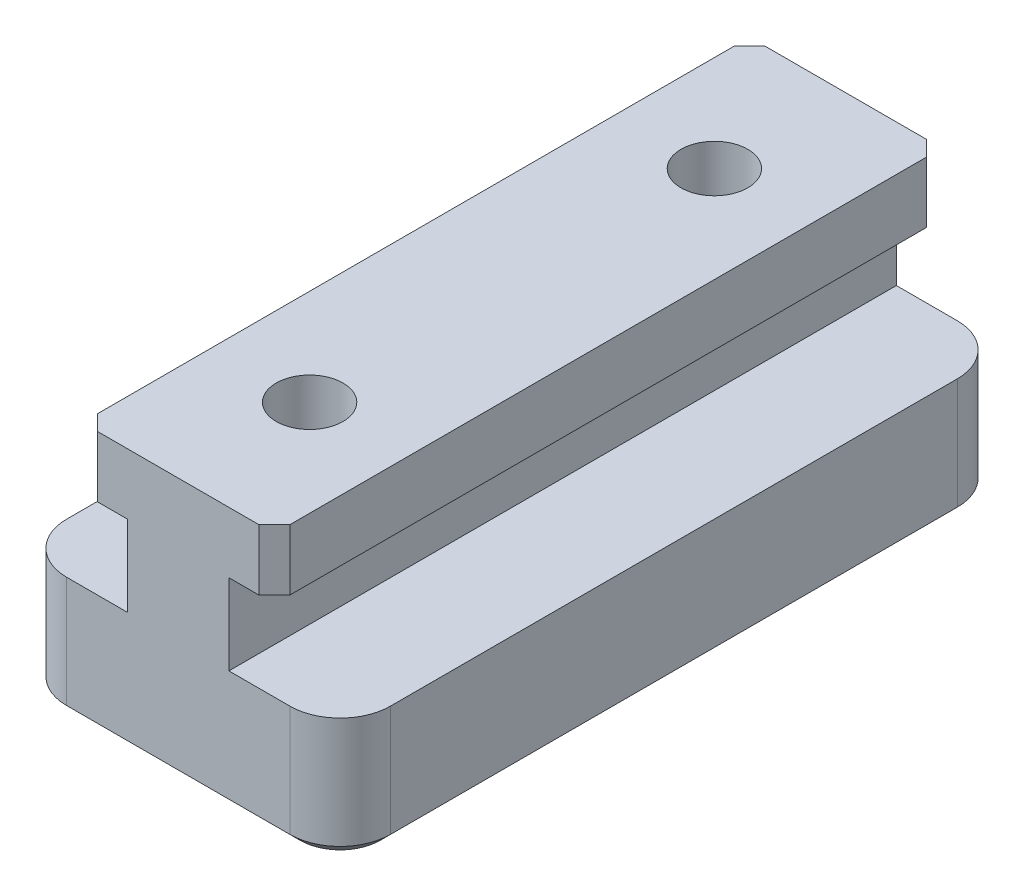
ISO-10303-21;
HEADER;
FILE_DESCRIPTION(('STEP AP214'),'2;1');
FILE_NAME('part.step','',(''),(''),'','','');
FILE_SCHEMA(('AUTOMOTIVE_DESIGN { 1 0 10303 214 1 1 1 1 }'));
ENDSEC;
DATA;
#1=APPLICATION_CONTEXT('core data for automotive mechanical design processes');
#2=APPLICATION_PROTOCOL_DEFINITION('international standard','automotive_design',2000,#1);
#3=PRODUCT_CONTEXT('',#1,'mechanical');
#4=PRODUCT('Part','Part','',(#3));
#5=PRODUCT_RELATED_PRODUCT_CATEGORY('part','',(#4));
#6=PRODUCT_DEFINITION_FORMATION('','',#4);
#7=PRODUCT_DEFINITION_CONTEXT('part definition',#1,'design');
#8=PRODUCT_DEFINITION('design','',#6,#7);
#9=PRODUCT_DEFINITION_SHAPE('','',#8);
#10=(LENGTH_UNIT() NAMED_UNIT(*) SI_UNIT(.MILLI.,.METRE.));
#11=(NAMED_UNIT(*) PLANE_ANGLE_UNIT() SI_UNIT($,.RADIAN.));
#12=(NAMED_UNIT(*) SI_UNIT($,.STERADIAN.) SOLID_ANGLE_UNIT());
#13=UNCERTAINTY_MEASURE_WITH_UNIT(LENGTH_MEASURE(1.E-05),#10,'distance_accuracy_value','');
#14=(GEOMETRIC_REPRESENTATION_CONTEXT(3) GLOBAL_UNCERTAINTY_ASSIGNED_CONTEXT((#13)) GLOBAL_UNIT_ASSIGNED_CONTEXT((#10,
#11,#12)) REPRESENTATION_CONTEXT('',''));
#15=CARTESIAN_POINT('',(0.,0.,0.));
#16=DIRECTION('',(0.,0.,1.));
#17=DIRECTION('',(1.,0.,0.));
#18=AXIS2_PLACEMENT_3D('',#15,#16,#17);
#19=CARTESIAN_POINT('',(-4.7498,5.0038,16.49));
#20=DIRECTION('',(1.,0.,0.));
#21=DIRECTION('',(0.,0.,-1.));
#22=AXIS2_PLACEMENT_3D('',#19,#20,#21);
#23=PLANE('',#22);
#24=DIRECTION('',(0.,0.,-1.));
#25=VECTOR('',#24,1.);
#26=CARTESIAN_POINT('',(-4.7498,5.0038,16.49));
#27=LINE('',#26,#25);
#28=CARTESIAN_POINT('',(-4.7498,5.0038,15.728));
#29=VERTEX_POINT('',#28);
#30=CARTESIAN_POINT('',(-4.7498,5.0038,-15.728));
#31=VERTEX_POINT('',#30);
#32=EDGE_CURVE('E239',#29,#31,#27,.T.);
#33=ORIENTED_EDGE('',*,*,#32,.T.);
#34=DIRECTION('',(0.,-1.,0.));
#35=VECTOR('',#34,1.);
#36=CARTESIAN_POINT('',(-4.7498,5.0038,-15.728));
#37=LINE('',#36,#35);
#38=CARTESIAN_POINT('',(-4.7498,1.9916,-15.728));
#39=VERTEX_POINT('',#38);
#40=EDGE_CURVE('E385',#31,#39,#37,.T.);
#41=ORIENTED_EDGE('',*,*,#40,.T.);
#42=DIRECTION('',(0.,0.,-1.));
#43=VECTOR('',#42,1.);
#44=CARTESIAN_POINT('',(-4.7498,1.9916,16.49));
#45=LINE('',#44,#43);
#46=CARTESIAN_POINT('',(-4.7498,1.9916,15.728));
#47=VERTEX_POINT('',#46);
#48=EDGE_CURVE('E219',#47,#39,#45,.T.);
#49=ORIENTED_EDGE('',*,*,#48,.F.);
#50=DIRECTION('',(0.,1.,0.));
#51=VECTOR('',#50,1.);
#52=CARTESIAN_POINT('',(-4.7498,5.0038,15.728));
#53=LINE('',#52,#51);
#54=EDGE_CURVE('E383',#47,#29,#53,.T.);
#55=ORIENTED_EDGE('',*,*,#54,.T.);
#56=EDGE_LOOP('',(#33,#41,#49,#55));
#57=FACE_BOUND('',#56,.T.);
#58=ADVANCED_FACE('F39',(#57),#23,.F.);
#59=CARTESIAN_POINT('',(-4.7498,1.9916,16.49));
#60=DIRECTION('',(0.,1.,0.));
#61=DIRECTION('',(-1.,0.,0.));
#62=AXIS2_PLACEMENT_3D('',#59,#60,#61);
#63=PLANE('',#62);
#64=ORIENTED_EDGE('',*,*,#48,.T.);
#65=DIRECTION('',(-0.707106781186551,0.,0.707106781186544));
#66=VECTOR('',#65,1.);
#67=CARTESIAN_POINT('',(-4.7498,1.9916,-15.728));
#68=LINE('',#67,#66);
#69=CARTESIAN_POINT('',(-3.98779999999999,1.9916,-16.49));
#70=VERTEX_POINT('',#69);
#71=EDGE_CURVE('E61',#39,#70,#68,.F.);
#72=ORIENTED_EDGE('',*,*,#71,.T.);
#73=DIRECTION('',(1.,0.,0.));
#74=VECTOR('',#73,1.);
#75=CARTESIAN_POINT('',(-4.7498,1.9916,-16.49));
#76=LINE('',#75,#74);
#77=CARTESIAN_POINT('',(-2.5019,1.9916,-16.49));
#78=VERTEX_POINT('',#77);
#79=EDGE_CURVE('E216',#70,#78,#76,.T.);
#80=ORIENTED_EDGE('',*,*,#79,.T.);
#81=DIRECTION('',(0.,0.,-1.));
#82=VECTOR('',#81,1.);
#83=CARTESIAN_POINT('',(-2.5019,1.9916,16.49));
#84=LINE('',#83,#82);
#85=CARTESIAN_POINT('',(-2.5019,1.9916,16.49));
#86=VERTEX_POINT('',#85);
#87=EDGE_CURVE('E212',#86,#78,#84,.T.);
#88=ORIENTED_EDGE('',*,*,#87,.F.);
#89=DIRECTION('',(1.,0.,0.));
#90=VECTOR('',#89,1.);
#91=CARTESIAN_POINT('',(-4.7498,1.9916,16.49));
#92=LINE('',#91,#90);
#93=CARTESIAN_POINT('',(-3.9878,1.9916,16.49));
#94=VERTEX_POINT('',#93);
#95=EDGE_CURVE('E200',#94,#86,#92,.T.);
#96=ORIENTED_EDGE('',*,*,#95,.F.);
#97=DIRECTION('',(-0.707106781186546,0.,-0.707106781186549));
#98=VECTOR('',#97,1.);
#99=CARTESIAN_POINT('',(-3.9878,1.9916,16.49));
#100=LINE('',#99,#98);
#101=EDGE_CURVE('E54',#94,#47,#100,.T.);
#102=ORIENTED_EDGE('',*,*,#101,.T.);
#103=EDGE_LOOP('',(#64,#72,#80,#88,#96,#102));
#104=FACE_BOUND('',#103,.T.);
#105=ADVANCED_FACE('F214',(#104),#63,.F.);
#106=CARTESIAN_POINT('',(-2.5019,1.9916,16.49));
#107=DIRECTION('',(1.,0.,0.));
#108=DIRECTION('',(0.,1.,0.));
#109=AXIS2_PLACEMENT_3D('',#106,#107,#108);
#110=PLANE('',#109);
#111=DIRECTION('',(0.,-1.,0.));
#112=VECTOR('',#111,1.);
#113=CARTESIAN_POINT('',(-2.5019,1.9916,-16.49));
#114=LINE('',#113,#112);
#115=CARTESIAN_POINT('',(-2.5019,-1.9962,-16.49));
#116=VERTEX_POINT('',#115);
#117=EDGE_CURVE('E241',#78,#116,#114,.T.);
#118=ORIENTED_EDGE('',*,*,#117,.T.);
#119=DIRECTION('',(0.,0.,-1.));
#120=VECTOR('',#119,1.);
#121=CARTESIAN_POINT('',(-2.5019,-1.9962,16.49));
#122=LINE('',#121,#120);
#123=CARTESIAN_POINT('',(-2.5019,-1.9962,16.49));
#124=VERTEX_POINT('',#123);
#125=EDGE_CURVE('E220',#124,#116,#122,.T.);
#126=ORIENTED_EDGE('',*,*,#125,.F.);
#127=DIRECTION('',(0.,-1.,0.));
#128=VECTOR('',#127,1.);
#129=CARTESIAN_POINT('',(-2.5019,1.9916,16.49));
#130=LINE('',#129,#128);
#131=EDGE_CURVE('E206',#86,#124,#130,.T.);
#132=ORIENTED_EDGE('',*,*,#131,.F.);
#133=ORIENTED_EDGE('',*,*,#87,.T.);
#134=EDGE_LOOP('',(#118,#126,#132,#133));
#135=FACE_BOUND('',#134,.T.);
#136=ADVANCED_FACE('F222',(#135),#110,.F.);
#137=CARTESIAN_POINT('',(-2.5019,-1.9962,16.49));
#138=DIRECTION('',(0.,-1.,0.));
#139=DIRECTION('',(1.,0.,0.));
#140=AXIS2_PLACEMENT_3D('',#137,#138,#139);
#141=PLANE('',#140);
#142=DIRECTION('',(0.,0.,-1.));
#143=VECTOR('',#142,1.);
#144=CARTESIAN_POINT('',(-8.,-1.9962,16.49));
#145=LINE('',#144,#143);
#146=CARTESIAN_POINT('',(-8.,-1.9962,14.0008));
#147=VERTEX_POINT('',#146);
#148=CARTESIAN_POINT('',(-8.,-1.9962,-14.0008));
#149=VERTEX_POINT('',#148);
#150=EDGE_CURVE('E273',#147,#149,#145,.T.);
#151=ORIENTED_EDGE('',*,*,#150,.F.);
#152=CARTESIAN_POINT('',(-5.5108,-1.9962,14.0008));
#153=DIRECTION('',(0.,-1.,0.));
#154=DIRECTION('',(1.,0.,0.));
#155=AXIS2_PLACEMENT_3D('',#152,#153,#154);
#156=CIRCLE('',#155,2.4892);
#157=CARTESIAN_POINT('',(-5.5108,-1.9962,16.49));
#158=VERTEX_POINT('',#157);
#159=EDGE_CURVE('E290',#147,#158,#156,.F.);
#160=ORIENTED_EDGE('',*,*,#159,.T.);
#161=DIRECTION('',(-1.,0.,0.));
#162=VECTOR('',#161,1.);
#163=CARTESIAN_POINT('',(-2.5019,-1.9962,16.49));
#164=LINE('',#163,#162);
#165=EDGE_CURVE('E225',#124,#158,#164,.T.);
#166=ORIENTED_EDGE('',*,*,#165,.F.);
#167=ORIENTED_EDGE('',*,*,#125,.T.);
#168=DIRECTION('',(-1.,0.,0.));
#169=VECTOR('',#168,1.);
#170=CARTESIAN_POINT('',(-2.5019,-1.9962,-16.49));
#171=LINE('',#170,#169);
#172=CARTESIAN_POINT('',(-5.5108,-1.9962,-16.49));
#173=VERTEX_POINT('',#172);
#174=EDGE_CURVE('E244',#116,#173,#171,.T.);
#175=ORIENTED_EDGE('',*,*,#174,.T.);
#176=CARTESIAN_POINT('',(-5.5108,-1.9962,-14.0008));
#177=DIRECTION('',(0.,-1.,0.));
#178=DIRECTION('',(1.,0.,0.));
#179=AXIS2_PLACEMENT_3D('',#176,#177,#178);
#180=CIRCLE('',#179,2.4892);
#181=EDGE_CURVE('E288',#173,#149,#180,.F.);
#182=ORIENTED_EDGE('',*,*,#181,.T.);
#183=EDGE_LOOP('',(#151,#160,#166,#167,#175,#182));
#184=FACE_BOUND('',#183,.T.);
#185=ADVANCED_FACE('F765',(#184),#141,.F.);
#186=CARTESIAN_POINT('',(-8.,-1.9962,16.49));
#187=DIRECTION('',(1.,0.,0.));
#188=DIRECTION('',(0.,0.,-1.));
#189=AXIS2_PLACEMENT_3D('',#186,#187,#188);
#190=PLANE('',#189);
#191=DIRECTION('',(0.,-1.,0.));
#192=VECTOR('',#191,1.);
#193=CARTESIAN_POINT('',(-8.,-1.9962,-14.0008));
#194=LINE('',#193,#192);
#195=CARTESIAN_POINT('',(-8.,-7.4882,-14.0008));
#196=VERTEX_POINT('',#195);
#197=EDGE_CURVE('E283',#149,#196,#194,.T.);
#198=ORIENTED_EDGE('',*,*,#197,.T.);
#199=DIRECTION('',(0.,0.,1.));
#200=VECTOR('',#199,1.);
#201=CARTESIAN_POINT('',(-8.,-7.4882,16.49));
#202=LINE('',#201,#200);
#203=CARTESIAN_POINT('',(-8.,-7.4882,14.0008));
#204=VERTEX_POINT('',#203);
#205=EDGE_CURVE('E330',#196,#204,#202,.T.);
#206=ORIENTED_EDGE('',*,*,#205,.T.);
#207=DIRECTION('',(0.,-1.,0.));
#208=VECTOR('',#207,1.);
#209=CARTESIAN_POINT('',(-8.,-1.9962,14.0008));
#210=LINE('',#209,#208);
#211=EDGE_CURVE('E286',#204,#147,#210,.F.);
#212=ORIENTED_EDGE('',*,*,#211,.T.);
#213=ORIENTED_EDGE('',*,*,#150,.T.);
#214=EDGE_LOOP('',(#198,#206,#212,#213));
#215=FACE_BOUND('',#214,.T.);
#216=ADVANCED_FACE('F463',(#215),#190,.F.);
#217=CARTESIAN_POINT('',(-8.,-7.9962,16.49));
#218=DIRECTION('',(0.,1.,0.));
#219=DIRECTION('',(0.,0.,1.));
#220=AXIS2_PLACEMENT_3D('',#217,#218,#219);
#221=PLANE('',#220);
#222=CARTESIAN_POINT('',(0.,-7.9962,10.));
#223=DIRECTION('',(0.,-1.,0.));
#224=DIRECTION('',(0.,0.,-1.));
#225=AXIS2_PLACEMENT_3D('',#222,#223,#224);
#226=CIRCLE('',#225,1.65);
#227=CARTESIAN_POINT('',(0.,-7.9962,8.35));
#228=VERTEX_POINT('',#227);
#229=EDGE_CURVE('E831',#228,#228,#226,.T.);
#230=ORIENTED_EDGE('',*,*,#229,.F.);
#231=EDGE_LOOP('',(#230));
#232=FACE_BOUND('',#231,.T.);
#233=CARTESIAN_POINT('',(0.,-7.9962,-10.));
#234=DIRECTION('',(0.,-1.,0.));
#235=DIRECTION('',(0.,0.,-1.));
#236=AXIS2_PLACEMENT_3D('',#233,#234,#235);
#237=CIRCLE('',#236,1.65);
#238=CARTESIAN_POINT('',(0.,-7.9962,-11.65));
#239=VERTEX_POINT('',#238);
#240=EDGE_CURVE('E834',#239,#239,#237,.T.);
#241=ORIENTED_EDGE('',*,*,#240,.F.);
#242=EDGE_LOOP('',(#241));
#243=FACE_BOUND('',#242,.T.);
#244=CARTESIAN_POINT('',(-5.5108,-7.9962,-14.0008));
#245=DIRECTION('',(0.,1.,0.));
#246=DIRECTION('',(0.,0.,1.));
#247=AXIS2_PLACEMENT_3D('',#244,#245,#246);
#248=CIRCLE('',#247,1.9812);
#249=CARTESIAN_POINT('',(-7.492,-7.9962,-14.0008));
#250=VERTEX_POINT('',#249);
#251=CARTESIAN_POINT('',(-5.5108,-7.9962,-15.982));
#252=VERTEX_POINT('',#251);
#253=EDGE_CURVE('E318',#250,#252,#248,.F.);
#254=ORIENTED_EDGE('',*,*,#253,.T.);
#255=DIRECTION('',(1.,0.,0.));
#256=VECTOR('',#255,1.);
#257=CARTESIAN_POINT('',(-8.,-7.9962,-15.982));
#258=LINE('',#257,#256);
#259=CARTESIAN_POINT('',(5.5108,-7.9962,-15.982));
#260=VERTEX_POINT('',#259);
#261=EDGE_CURVE('E320',#252,#260,#258,.T.);
#262=ORIENTED_EDGE('',*,*,#261,.T.);
#263=CARTESIAN_POINT('',(5.5108,-7.9962,-14.0008));
#264=DIRECTION('',(0.,1.,0.));
#265=DIRECTION('',(0.,0.,1.));
#266=AXIS2_PLACEMENT_3D('',#263,#264,#265);
#267=CIRCLE('',#266,1.9812);
#268=CARTESIAN_POINT('',(7.492,-7.9962,-14.0008));
#269=VERTEX_POINT('',#268);
#270=EDGE_CURVE('E316',#260,#269,#267,.F.);
#271=ORIENTED_EDGE('',*,*,#270,.T.);
#272=DIRECTION('',(0.,0.,1.));
#273=VECTOR('',#272,1.);
#274=CARTESIAN_POINT('',(7.492,-7.9962,16.49));
#275=LINE('',#274,#273);
#276=CARTESIAN_POINT('',(7.492,-7.9962,14.0008));
#277=VERTEX_POINT('',#276);
#278=EDGE_CURVE('E312',#269,#277,#275,.T.);
#279=ORIENTED_EDGE('',*,*,#278,.T.);
#280=CARTESIAN_POINT('',(5.5108,-7.9962,14.0008));
#281=DIRECTION('',(0.,1.,0.));
#282=DIRECTION('',(0.,0.,1.));
#283=AXIS2_PLACEMENT_3D('',#280,#281,#282);
#284=CIRCLE('',#283,1.9812);
#285=CARTESIAN_POINT('',(5.5108,-7.9962,15.982));
#286=VERTEX_POINT('',#285);
#287=EDGE_CURVE('E308',#277,#286,#284,.F.);
#288=ORIENTED_EDGE('',*,*,#287,.T.);
#289=DIRECTION('',(-1.,0.,0.));
#290=VECTOR('',#289,1.);
#291=CARTESIAN_POINT('',(-5.5108,-7.9962,15.982));
#292=LINE('',#291,#290);
#293=CARTESIAN_POINT('',(-5.5108,-7.9962,15.982));
#294=VERTEX_POINT('',#293);
#295=EDGE_CURVE('E306',#286,#294,#292,.T.);
#296=ORIENTED_EDGE('',*,*,#295,.T.);
#297=CARTESIAN_POINT('',(-5.5108,-7.9962,14.0008));
#298=DIRECTION('',(0.,1.,0.));
#299=DIRECTION('',(0.,0.,1.));
#300=AXIS2_PLACEMENT_3D('',#297,#298,#299);
#301=CIRCLE('',#300,1.9812);
#302=CARTESIAN_POINT('',(-7.492,-7.9962,14.0008));
#303=VERTEX_POINT('',#302);
#304=EDGE_CURVE('E310',#294,#303,#301,.F.);
#305=ORIENTED_EDGE('',*,*,#304,.T.);
#306=DIRECTION('',(0.,0.,-1.));
#307=VECTOR('',#306,1.);
#308=CARTESIAN_POINT('',(-7.492,-7.9962,16.49));
#309=LINE('',#308,#307);
#310=EDGE_CURVE('E314',#303,#250,#309,.T.);
#311=ORIENTED_EDGE('',*,*,#310,.T.);
#312=EDGE_LOOP('',(#254,#262,#271,#279,#288,#296,#305,#311));
#313=FACE_BOUND('',#312,.T.);
#314=ADVANCED_FACE('F451',(#232,#243,#313),#221,.F.);
#315=CARTESIAN_POINT('',(8.,-1.9962,16.49));
#316=DIRECTION('',(-1.,0.,0.));
#317=DIRECTION('',(0.,0.,1.));
#318=AXIS2_PLACEMENT_3D('',#315,#316,#317);
#319=PLANE('',#318);
#320=DIRECTION('',(0.,1.,0.));
#321=VECTOR('',#320,1.);
#322=CARTESIAN_POINT('',(8.,-7.9962,14.0008));
#323=LINE('',#322,#321);
#324=CARTESIAN_POINT('',(8.,-1.9962,14.0008));
#325=VERTEX_POINT('',#324);
#326=CARTESIAN_POINT('',(8.,-7.4882,14.0008));
#327=VERTEX_POINT('',#326);
#328=EDGE_CURVE('E297',#325,#327,#323,.F.);
#329=ORIENTED_EDGE('',*,*,#328,.T.);
#330=DIRECTION('',(0.,0.,-1.));
#331=VECTOR('',#330,1.);
#332=CARTESIAN_POINT('',(8.,-7.4882,16.49));
#333=LINE('',#332,#331);
#334=CARTESIAN_POINT('',(8.,-7.4882,-14.0008));
#335=VERTEX_POINT('',#334);
#336=EDGE_CURVE('E332',#327,#335,#333,.T.);
#337=ORIENTED_EDGE('',*,*,#336,.T.);
#338=DIRECTION('',(0.,1.,0.));
#339=VECTOR('',#338,1.);
#340=CARTESIAN_POINT('',(8.,-1.9962,-14.0008));
#341=LINE('',#340,#339);
#342=CARTESIAN_POINT('',(8.,-1.9962,-14.0008));
#343=VERTEX_POINT('',#342);
#344=EDGE_CURVE('E300',#335,#343,#341,.T.);
#345=ORIENTED_EDGE('',*,*,#344,.T.);
#346=DIRECTION('',(0.,0.,-1.));
#347=VECTOR('',#346,1.);
#348=CARTESIAN_POINT('',(8.,-1.9962,16.49));
#349=LINE('',#348,#347);
#350=EDGE_CURVE('E270',#325,#343,#349,.T.);
#351=ORIENTED_EDGE('',*,*,#350,.F.);
#352=EDGE_LOOP('',(#329,#337,#345,#351));
#353=FACE_BOUND('',#352,.T.);
#354=ADVANCED_FACE('F495',(#353),#319,.F.);
#355=CARTESIAN_POINT('',(2.5019,-1.9962,16.49));
#356=DIRECTION('',(0.,-1.,0.));
#357=DIRECTION('',(1.,0.,0.));
#358=AXIS2_PLACEMENT_3D('',#355,#356,#357);
#359=PLANE('',#358);
#360=ORIENTED_EDGE('',*,*,#350,.T.);
#361=CARTESIAN_POINT('',(5.5108,-1.9962,-14.0008));
#362=DIRECTION('',(0.,-1.,0.));
#363=DIRECTION('',(1.,0.,0.));
#364=AXIS2_PLACEMENT_3D('',#361,#362,#363);
#365=CIRCLE('',#364,2.4892);
#366=CARTESIAN_POINT('',(5.5108,-1.9962,-16.49));
#367=VERTEX_POINT('',#366);
#368=EDGE_CURVE('E304',#343,#367,#365,.F.);
#369=ORIENTED_EDGE('',*,*,#368,.T.);
#370=DIRECTION('',(-1.,0.,0.));
#371=VECTOR('',#370,1.);
#372=CARTESIAN_POINT('',(2.5019,-1.9962,-16.49));
#373=LINE('',#372,#371);
#374=CARTESIAN_POINT('',(2.5019,-1.9962,-16.49));
#375=VERTEX_POINT('',#374);
#376=EDGE_CURVE('E247',#367,#375,#373,.T.);
#377=ORIENTED_EDGE('',*,*,#376,.T.);
#378=DIRECTION('',(0.,0.,-1.));
#379=VECTOR('',#378,1.);
#380=CARTESIAN_POINT('',(2.5019,-1.9962,16.49));
#381=LINE('',#380,#379);
#382=CARTESIAN_POINT('',(2.5019,-1.9962,16.49));
#383=VERTEX_POINT('',#382);
#384=EDGE_CURVE('E267',#383,#375,#381,.T.);
#385=ORIENTED_EDGE('',*,*,#384,.F.);
#386=DIRECTION('',(-1.,0.,0.));
#387=VECTOR('',#386,1.);
#388=CARTESIAN_POINT('',(2.5019,-1.9962,16.49));
#389=LINE('',#388,#387);
#390=CARTESIAN_POINT('',(5.5108,-1.9962,16.49));
#391=VERTEX_POINT('',#390);
#392=EDGE_CURVE('E227',#391,#383,#389,.T.);
#393=ORIENTED_EDGE('',*,*,#392,.F.);
#394=CARTESIAN_POINT('',(5.5108,-1.9962,14.0008));
#395=DIRECTION('',(0.,-1.,0.));
#396=DIRECTION('',(1.,0.,0.));
#397=AXIS2_PLACEMENT_3D('',#394,#395,#396);
#398=CIRCLE('',#397,2.4892);
#399=EDGE_CURVE('E302',#391,#325,#398,.F.);
#400=ORIENTED_EDGE('',*,*,#399,.T.);
#401=EDGE_LOOP('',(#360,#369,#377,#385,#393,#400));
#402=FACE_BOUND('',#401,.T.);
#403=ADVANCED_FACE('F430',(#402),#359,.F.);
#404=CARTESIAN_POINT('',(2.5019,1.9916,16.49));
#405=DIRECTION('',(-1.,0.,0.));
#406=DIRECTION('',(0.,-1.,0.));
#407=AXIS2_PLACEMENT_3D('',#404,#405,#406);
#408=PLANE('',#407);
#409=DIRECTION('',(0.,1.,0.));
#410=VECTOR('',#409,1.);
#411=CARTESIAN_POINT('',(2.5019,1.9916,-16.49));
#412=LINE('',#411,#410);
#413=CARTESIAN_POINT('',(2.5019,1.9916,-16.49));
#414=VERTEX_POINT('',#413);
#415=EDGE_CURVE('E249',#375,#414,#412,.T.);
#416=ORIENTED_EDGE('',*,*,#415,.T.);
#417=DIRECTION('',(0.,0.,-1.));
#418=VECTOR('',#417,1.);
#419=CARTESIAN_POINT('',(2.5019,1.9916,16.49));
#420=LINE('',#419,#418);
#421=CARTESIAN_POINT('',(2.5019,1.9916,16.49));
#422=VERTEX_POINT('',#421);
#423=EDGE_CURVE('E264',#422,#414,#420,.T.);
#424=ORIENTED_EDGE('',*,*,#423,.F.);
#425=DIRECTION('',(0.,1.,0.));
#426=VECTOR('',#425,1.);
#427=CARTESIAN_POINT('',(2.5019,1.9916,16.49));
#428=LINE('',#427,#426);
#429=EDGE_CURVE('E232',#383,#422,#428,.T.);
#430=ORIENTED_EDGE('',*,*,#429,.F.);
#431=ORIENTED_EDGE('',*,*,#384,.T.);
#432=EDGE_LOOP('',(#416,#424,#430,#431));
#433=FACE_BOUND('',#432,.T.);
#434=ADVANCED_FACE('F426',(#433),#408,.F.);
#435=CARTESIAN_POINT('',(4.7498,1.9916,16.49));
#436=DIRECTION('',(0.,1.,0.));
#437=DIRECTION('',(-1.,0.,0.));
#438=AXIS2_PLACEMENT_3D('',#435,#436,#437);
#439=PLANE('',#438);
#440=DIRECTION('',(1.,0.,0.));
#441=VECTOR('',#440,1.);
#442=CARTESIAN_POINT('',(4.7498,1.9916,-16.49));
#443=LINE('',#442,#441);
#444=CARTESIAN_POINT('',(3.98779999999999,1.9916,-16.49));
#445=VERTEX_POINT('',#444);
#446=EDGE_CURVE('E251',#414,#445,#443,.T.);
#447=ORIENTED_EDGE('',*,*,#446,.T.);
#448=DIRECTION('',(-0.707106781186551,0.,-0.707106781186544));
#449=VECTOR('',#448,1.);
#450=CARTESIAN_POINT('',(4.7498,1.9916,-15.728));
#451=LINE('',#450,#449);
#452=CARTESIAN_POINT('',(4.7498,1.9916,-15.728));
#453=VERTEX_POINT('',#452);
#454=EDGE_CURVE('E381',#445,#453,#451,.F.);
#455=ORIENTED_EDGE('',*,*,#454,.T.);
#456=DIRECTION('',(0.,0.,-1.));
#457=VECTOR('',#456,1.);
#458=CARTESIAN_POINT('',(4.7498,1.9916,16.49));
#459=LINE('',#458,#457);
#460=CARTESIAN_POINT('',(4.7498,1.9916,15.728));
#461=VERTEX_POINT('',#460);
#462=EDGE_CURVE('E261',#461,#453,#459,.T.);
#463=ORIENTED_EDGE('',*,*,#462,.F.);
#464=DIRECTION('',(-0.707106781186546,0.,0.707106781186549));
#465=VECTOR('',#464,1.);
#466=CARTESIAN_POINT('',(3.9878,1.9916,16.49));
#467=LINE('',#466,#465);
#468=CARTESIAN_POINT('',(3.9878,1.9916,16.49));
#469=VERTEX_POINT('',#468);
#470=EDGE_CURVE('E379',#461,#469,#467,.T.);
#471=ORIENTED_EDGE('',*,*,#470,.T.);
#472=DIRECTION('',(1.,0.,0.));
#473=VECTOR('',#472,1.);
#474=CARTESIAN_POINT('',(4.7498,1.9916,16.49));
#475=LINE('',#474,#473);
#476=EDGE_CURVE('E234',#422,#469,#475,.T.);
#477=ORIENTED_EDGE('',*,*,#476,.F.);
#478=ORIENTED_EDGE('',*,*,#423,.T.);
#479=EDGE_LOOP('',(#447,#455,#463,#471,#477,#478));
#480=FACE_BOUND('',#479,.T.);
#481=ADVANCED_FACE('F416',(#480),#439,.F.);
#482=CARTESIAN_POINT('',(4.7498,5.0038,16.49));
#483=DIRECTION('',(-1.,0.,0.));
#484=DIRECTION('',(0.,0.,1.));
#485=AXIS2_PLACEMENT_3D('',#482,#483,#484);
#486=PLANE('',#485);
#487=ORIENTED_EDGE('',*,*,#462,.T.);
#488=DIRECTION('',(0.,1.,0.));
#489=VECTOR('',#488,1.);
#490=CARTESIAN_POINT('',(4.7498,5.0038,-15.728));
#491=LINE('',#490,#489);
#492=CARTESIAN_POINT('',(4.7498,5.0038,-15.728));
#493=VERTEX_POINT('',#492);
#494=EDGE_CURVE('E364',#453,#493,#491,.T.);
#495=ORIENTED_EDGE('',*,*,#494,.T.);
#496=DIRECTION('',(0.,0.,-1.));
#497=VECTOR('',#496,1.);
#498=CARTESIAN_POINT('',(4.7498,5.0038,16.49));
#499=LINE('',#498,#497);
#500=CARTESIAN_POINT('',(4.7498,5.0038,15.728));
#501=VERTEX_POINT('',#500);
#502=EDGE_CURVE('E258',#501,#493,#499,.T.);
#503=ORIENTED_EDGE('',*,*,#502,.F.);
#504=DIRECTION('',(0.,-1.,0.));
#505=VECTOR('',#504,1.);
#506=CARTESIAN_POINT('',(4.7498,1.9916,15.728));
#507=LINE('',#506,#505);
#508=EDGE_CURVE('E340',#501,#461,#507,.T.);
#509=ORIENTED_EDGE('',*,*,#508,.T.);
#510=EDGE_LOOP('',(#487,#495,#503,#509));
#511=FACE_BOUND('',#510,.T.);
#512=ADVANCED_FACE('F418',(#511),#486,.F.);
#513=CARTESIAN_POINT('',(4.7498,5.0038,16.49));
#514=DIRECTION('',(0.,-1.,0.));
#515=DIRECTION('',(0.,0.,-1.));
#516=AXIS2_PLACEMENT_3D('',#513,#514,#515);
#517=PLANE('',#516);
#518=CARTESIAN_POINT('',(0.,5.0038,10.));
#519=DIRECTION('',(0.,-1.,0.));
#520=DIRECTION('',(0.,0.,-1.));
#521=AXIS2_PLACEMENT_3D('',#518,#519,#520);
#522=CIRCLE('',#521,1.65);
#523=CARTESIAN_POINT('',(0.,5.0038,8.35));
#524=VERTEX_POINT('',#523);
#525=EDGE_CURVE('E836',#524,#524,#522,.T.);
#526=ORIENTED_EDGE('',*,*,#525,.T.);
#527=EDGE_LOOP('',(#526));
#528=FACE_BOUND('',#527,.T.);
#529=CARTESIAN_POINT('',(0.,5.0038,-10.));
#530=DIRECTION('',(0.,-1.,0.));
#531=DIRECTION('',(0.,0.,-1.));
#532=AXIS2_PLACEMENT_3D('',#529,#530,#531);
#533=CIRCLE('',#532,1.65);
#534=CARTESIAN_POINT('',(0.,5.0038,-11.65));
#535=VERTEX_POINT('',#534);
#536=EDGE_CURVE('E344',#535,#535,#533,.T.);
#537=ORIENTED_EDGE('',*,*,#536,.T.);
#538=EDGE_LOOP('',(#537));
#539=FACE_BOUND('',#538,.T.);
#540=ORIENTED_EDGE('',*,*,#502,.T.);
#541=DIRECTION('',(0.707106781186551,0.,0.707106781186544));
#542=VECTOR('',#541,1.);
#543=CARTESIAN_POINT('',(4.7498,5.0038,-15.728));
#544=LINE('',#543,#542);
#545=CARTESIAN_POINT('',(3.98779999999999,5.0038,-16.49));
#546=VERTEX_POINT('',#545);
#547=EDGE_CURVE('E373',#493,#546,#544,.F.);
#548=ORIENTED_EDGE('',*,*,#547,.T.);
#549=DIRECTION('',(-1.,0.,0.));
#550=VECTOR('',#549,1.);
#551=CARTESIAN_POINT('',(4.7498,5.0038,-16.49));
#552=LINE('',#551,#550);
#553=CARTESIAN_POINT('',(-3.98779999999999,5.0038,-16.49));
#554=VERTEX_POINT('',#553);
#555=EDGE_CURVE('E209',#546,#554,#552,.T.);
#556=ORIENTED_EDGE('',*,*,#555,.T.);
#557=DIRECTION('',(0.707106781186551,0.,-0.707106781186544));
#558=VECTOR('',#557,1.);
#559=CARTESIAN_POINT('',(-4.7498,5.0038,-15.728));
#560=LINE('',#559,#558);
#561=EDGE_CURVE('E371',#554,#31,#560,.F.);
#562=ORIENTED_EDGE('',*,*,#561,.T.);
#563=ORIENTED_EDGE('',*,*,#32,.F.);
#564=DIRECTION('',(0.707106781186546,0.,0.707106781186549));
#565=VECTOR('',#564,1.);
#566=CARTESIAN_POINT('',(-3.9878,5.0038,16.49));
#567=LINE('',#566,#565);
#568=CARTESIAN_POINT('',(-3.9878,5.0038,16.49));
#569=VERTEX_POINT('',#568);
#570=EDGE_CURVE('E369',#29,#569,#567,.T.);
#571=ORIENTED_EDGE('',*,*,#570,.T.);
#572=DIRECTION('',(-1.,0.,0.));
#573=VECTOR('',#572,1.);
#574=CARTESIAN_POINT('',(4.7498,5.0038,16.49));
#575=LINE('',#574,#573);
#576=CARTESIAN_POINT('',(3.9878,5.0038,16.49));
#577=VERTEX_POINT('',#576);
#578=EDGE_CURVE('E237',#577,#569,#575,.T.);
#579=ORIENTED_EDGE('',*,*,#578,.F.);
#580=DIRECTION('',(0.707106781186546,0.,-0.707106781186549));
#581=VECTOR('',#580,1.);
#582=CARTESIAN_POINT('',(3.9878,5.0038,16.49));
#583=LINE('',#582,#581);
#584=EDGE_CURVE('E367',#577,#501,#583,.T.);
#585=ORIENTED_EDGE('',*,*,#584,.T.);
#586=EDGE_LOOP('',(#540,#548,#556,#562,#563,#571,#579,#585));
#587=FACE_BOUND('',#586,.T.);
#588=ADVANCED_FACE('F395',(#528,#539,#587),#517,.F.);
#589=CARTESIAN_POINT('',(0.,0.,16.49));
#590=DIRECTION('',(0.,0.,1.));
#591=DIRECTION('',(1.,0.,0.));
#592=AXIS2_PLACEMENT_3D('',#589,#590,#591);
#593=PLANE('',#592);
#594=ORIENTED_EDGE('',*,*,#578,.T.);
#595=DIRECTION('',(0.,-1.,0.));
#596=VECTOR('',#595,1.);
#597=CARTESIAN_POINT('',(-3.9878,1.9916,16.49));
#598=LINE('',#597,#596);
#599=EDGE_CURVE('E11',#569,#94,#598,.T.);
#600=ORIENTED_EDGE('',*,*,#599,.T.);
#601=ORIENTED_EDGE('',*,*,#95,.T.);
#602=ORIENTED_EDGE('',*,*,#131,.T.);
#603=ORIENTED_EDGE('',*,*,#165,.T.);
#604=DIRECTION('',(0.,-1.,0.));
#605=VECTOR('',#604,1.);
#606=CARTESIAN_POINT('',(-5.5108,-7.9962,16.49));
#607=LINE('',#606,#605);
#608=CARTESIAN_POINT('',(-5.5108,-7.4882,16.49));
#609=VERTEX_POINT('',#608);
#610=EDGE_CURVE('E280',#158,#609,#607,.T.);
#611=ORIENTED_EDGE('',*,*,#610,.T.);
#612=DIRECTION('',(1.,0.,0.));
#613=VECTOR('',#612,1.);
#614=CARTESIAN_POINT('',(5.5108,-7.4882,16.49));
#615=LINE('',#614,#613);
#616=CARTESIAN_POINT('',(5.5108,-7.4882,16.49));
#617=VERTEX_POINT('',#616);
#618=EDGE_CURVE('E338',#609,#617,#615,.T.);
#619=ORIENTED_EDGE('',*,*,#618,.T.);
#620=DIRECTION('',(0.,1.,0.));
#621=VECTOR('',#620,1.);
#622=CARTESIAN_POINT('',(5.5108,-1.9962,16.49));
#623=LINE('',#622,#621);
#624=EDGE_CURVE('E278',#617,#391,#623,.T.);
#625=ORIENTED_EDGE('',*,*,#624,.T.);
#626=ORIENTED_EDGE('',*,*,#392,.T.);
#627=ORIENTED_EDGE('',*,*,#429,.T.);
#628=ORIENTED_EDGE('',*,*,#476,.T.);
#629=DIRECTION('',(0.,1.,0.));
#630=VECTOR('',#629,1.);
#631=CARTESIAN_POINT('',(3.9878,5.0038,16.49));
#632=LINE('',#631,#630);
#633=EDGE_CURVE('E47',#469,#577,#632,.T.);
#634=ORIENTED_EDGE('',*,*,#633,.T.);
#635=EDGE_LOOP('',(#594,#600,#601,#602,#603,#611,#619,#625,#626,#627,#628,#634));
#636=FACE_BOUND('',#635,.T.);
#637=ADVANCED_FACE('F203',(#636),#593,.T.);
#638=CARTESIAN_POINT('',(0.,0.,-16.49));
#639=DIRECTION('',(0.,0.,1.));
#640=DIRECTION('',(1.,0.,0.));
#641=AXIS2_PLACEMENT_3D('',#638,#639,#640);
#642=PLANE('',#641);
#643=ORIENTED_EDGE('',*,*,#555,.F.);
#644=DIRECTION('',(0.,-1.,0.));
#645=VECTOR('',#644,1.);
#646=CARTESIAN_POINT('',(3.98779999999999,0.,-16.49));
#647=LINE('',#646,#645);
#648=EDGE_CURVE('E377',#546,#445,#647,.T.);
#649=ORIENTED_EDGE('',*,*,#648,.T.);
#650=ORIENTED_EDGE('',*,*,#446,.F.);
#651=ORIENTED_EDGE('',*,*,#415,.F.);
#652=ORIENTED_EDGE('',*,*,#376,.F.);
#653=DIRECTION('',(0.,1.,0.));
#654=VECTOR('',#653,1.);
#655=CARTESIAN_POINT('',(5.5108,0.,-16.49));
#656=LINE('',#655,#654);
#657=CARTESIAN_POINT('',(5.5108,-7.4882,-16.49));
#658=VERTEX_POINT('',#657);
#659=EDGE_CURVE('E292',#367,#658,#656,.F.);
#660=ORIENTED_EDGE('',*,*,#659,.T.);
#661=DIRECTION('',(-1.,0.,0.));
#662=VECTOR('',#661,1.);
#663=CARTESIAN_POINT('',(0.,-7.4882,-16.49));
#664=LINE('',#663,#662);
#665=CARTESIAN_POINT('',(-5.5108,-7.4882,-16.49));
#666=VERTEX_POINT('',#665);
#667=EDGE_CURVE('E323',#658,#666,#664,.T.);
#668=ORIENTED_EDGE('',*,*,#667,.T.);
#669=DIRECTION('',(0.,-1.,0.));
#670=VECTOR('',#669,1.);
#671=CARTESIAN_POINT('',(-5.5108,0.,-16.49));
#672=LINE('',#671,#670);
#673=EDGE_CURVE('E295',#666,#173,#672,.F.);
#674=ORIENTED_EDGE('',*,*,#673,.T.);
#675=ORIENTED_EDGE('',*,*,#174,.F.);
#676=ORIENTED_EDGE('',*,*,#117,.F.);
#677=ORIENTED_EDGE('',*,*,#79,.F.);
#678=DIRECTION('',(0.,1.,0.));
#679=VECTOR('',#678,1.);
#680=CARTESIAN_POINT('',(-3.98779999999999,0.,-16.49));
#681=LINE('',#680,#679);
#682=EDGE_CURVE('E375',#70,#554,#681,.T.);
#683=ORIENTED_EDGE('',*,*,#682,.T.);
#684=EDGE_LOOP('',(#643,#649,#650,#651,#652,#660,#668,#674,#675,#676,#677,#683));
#685=FACE_BOUND('',#684,.T.);
#686=ADVANCED_FACE('F404',(#685),#642,.F.);
#687=CARTESIAN_POINT('',(-5.5108,0.,14.0008));
#688=DIRECTION('',(0.,1.,0.));
#689=DIRECTION('',(0.,0.,1.));
#690=AXIS2_PLACEMENT_3D('',#687,#688,#689);
#691=CYLINDRICAL_SURFACE('',#690,2.4892);
#692=ORIENTED_EDGE('',*,*,#211,.F.);
#693=CARTESIAN_POINT('',(-5.5108,-7.4882,14.0008));
#694=DIRECTION('',(0.,1.,0.));
#695=DIRECTION('',(0.,0.,1.));
#696=AXIS2_PLACEMENT_3D('',#693,#694,#695);
#697=CIRCLE('',#696,2.4892);
#698=EDGE_CURVE('E334',#204,#609,#697,.T.);
#699=ORIENTED_EDGE('',*,*,#698,.T.);
#700=ORIENTED_EDGE('',*,*,#610,.F.);
#701=ORIENTED_EDGE('',*,*,#159,.F.);
#702=EDGE_LOOP('',(#692,#699,#700,#701));
#703=FACE_BOUND('',#702,.T.);
#704=ADVANCED_FACE('F476',(#703),#691,.T.);
#705=CARTESIAN_POINT('',(-5.5108,-1.9962,-14.0008));
#706=DIRECTION('',(0.,-1.,0.));
#707=DIRECTION('',(0.,0.,-1.));
#708=AXIS2_PLACEMENT_3D('',#705,#706,#707);
#709=CYLINDRICAL_SURFACE('',#708,2.4892);
#710=ORIENTED_EDGE('',*,*,#673,.F.);
#711=CARTESIAN_POINT('',(-5.5108,-7.4882,-14.0008));
#712=DIRECTION('',(0.,1.,0.));
#713=DIRECTION('',(0.,0.,1.));
#714=AXIS2_PLACEMENT_3D('',#711,#712,#713);
#715=CIRCLE('',#714,2.4892);
#716=EDGE_CURVE('E326',#666,#196,#715,.T.);
#717=ORIENTED_EDGE('',*,*,#716,.T.);
#718=ORIENTED_EDGE('',*,*,#197,.F.);
#719=ORIENTED_EDGE('',*,*,#181,.F.);
#720=EDGE_LOOP('',(#710,#717,#718,#719));
#721=FACE_BOUND('',#720,.T.);
#722=ADVANCED_FACE('F459',(#721),#709,.T.);
#723=CARTESIAN_POINT('',(5.5108,-1.9962,-14.0008));
#724=DIRECTION('',(0.,1.,0.));
#725=DIRECTION('',(0.,0.,1.));
#726=AXIS2_PLACEMENT_3D('',#723,#724,#725);
#727=CYLINDRICAL_SURFACE('',#726,2.4892);
#728=ORIENTED_EDGE('',*,*,#344,.F.);
#729=CARTESIAN_POINT('',(5.5108,-7.4882,-14.0008));
#730=DIRECTION('',(0.,1.,0.));
#731=DIRECTION('',(0.,0.,1.));
#732=AXIS2_PLACEMENT_3D('',#729,#730,#731);
#733=CIRCLE('',#732,2.4892);
#734=EDGE_CURVE('E328',#335,#658,#733,.T.);
#735=ORIENTED_EDGE('',*,*,#734,.T.);
#736=ORIENTED_EDGE('',*,*,#659,.F.);
#737=ORIENTED_EDGE('',*,*,#368,.F.);
#738=EDGE_LOOP('',(#728,#735,#736,#737));
#739=FACE_BOUND('',#738,.T.);
#740=ADVANCED_FACE('F435',(#739),#727,.T.);
#741=CARTESIAN_POINT('',(5.5108,0.,14.0008));
#742=DIRECTION('',(0.,-1.,0.));
#743=DIRECTION('',(0.,0.,-1.));
#744=AXIS2_PLACEMENT_3D('',#741,#742,#743);
#745=CYLINDRICAL_SURFACE('',#744,2.4892);
#746=ORIENTED_EDGE('',*,*,#624,.F.);
#747=CARTESIAN_POINT('',(5.5108,-7.4882,14.0008));
#748=DIRECTION('',(0.,1.,0.));
#749=DIRECTION('',(0.,0.,1.));
#750=AXIS2_PLACEMENT_3D('',#747,#748,#749);
#751=CIRCLE('',#750,2.4892);
#752=EDGE_CURVE('E336',#617,#327,#751,.T.);
#753=ORIENTED_EDGE('',*,*,#752,.T.);
#754=ORIENTED_EDGE('',*,*,#328,.F.);
#755=ORIENTED_EDGE('',*,*,#399,.F.);
#756=EDGE_LOOP('',(#746,#753,#754,#755));
#757=FACE_BOUND('',#756,.T.);
#758=ADVANCED_FACE('F492',(#757),#745,.T.);
#759=CARTESIAN_POINT('',(0.,-7.4882,16.49));
#760=DIRECTION('',(0.,-0.70710678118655,0.707106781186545));
#761=DIRECTION('',(-1.,0.,0.));
#762=AXIS2_PLACEMENT_3D('',#759,#760,#761);
#763=PLANE('',#762);
#764=DIRECTION('',(0.,-0.707106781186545,-0.70710678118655));
#765=VECTOR('',#764,1.);
#766=CARTESIAN_POINT('',(5.5108,-7.4882,16.49));
#767=LINE('',#766,#765);
#768=EDGE_CURVE('E358',#617,#286,#767,.T.);
#769=ORIENTED_EDGE('',*,*,#768,.F.);
#770=ORIENTED_EDGE('',*,*,#618,.F.);
#771=DIRECTION('',(0.,0.707106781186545,0.70710678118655));
#772=VECTOR('',#771,1.);
#773=CARTESIAN_POINT('',(-5.5108,-7.9962,15.982));
#774=LINE('',#773,#772);
#775=EDGE_CURVE('E242',#294,#609,#774,.T.);
#776=ORIENTED_EDGE('',*,*,#775,.F.);
#777=ORIENTED_EDGE('',*,*,#295,.F.);
#778=EDGE_LOOP('',(#769,#770,#776,#777));
#779=FACE_BOUND('',#778,.T.);
#780=ADVANCED_FACE('F482',(#779),#763,.T.);
#781=CARTESIAN_POINT('',(-5.5108,-7.9962,14.0008));
#782=DIRECTION('',(0.,1.,0.));
#783=DIRECTION('',(0.,0.,1.));
#784=AXIS2_PLACEMENT_3D('',#781,#782,#783);
#785=CONICAL_SURFACE('',#784,1.9812,0.785398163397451);
#786=ORIENTED_EDGE('',*,*,#775,.T.);
#787=ORIENTED_EDGE('',*,*,#698,.F.);
#788=DIRECTION('',(-0.70710678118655,0.707106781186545,0.));
#789=VECTOR('',#788,1.);
#790=CARTESIAN_POINT('',(-7.492,-7.9962,14.0008));
#791=LINE('',#790,#789);
#792=EDGE_CURVE('E355',#303,#204,#791,.T.);
#793=ORIENTED_EDGE('',*,*,#792,.F.);
#794=ORIENTED_EDGE('',*,*,#304,.F.);
#795=EDGE_LOOP('',(#786,#787,#793,#794));
#796=FACE_BOUND('',#795,.T.);
#797=ADVANCED_FACE('F472',(#796),#785,.T.);
#798=CARTESIAN_POINT('',(5.5108,-7.9962,14.0008));
#799=DIRECTION('',(0.,1.,0.));
#800=DIRECTION('',(0.,0.,1.));
#801=AXIS2_PLACEMENT_3D('',#798,#799,#800);
#802=CONICAL_SURFACE('',#801,1.9812,0.785398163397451);
#803=ORIENTED_EDGE('',*,*,#768,.T.);
#804=ORIENTED_EDGE('',*,*,#287,.F.);
#805=DIRECTION('',(-0.70710678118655,-0.707106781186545,0.));
#806=VECTOR('',#805,1.);
#807=CARTESIAN_POINT('',(8.,-7.4882,14.0008));
#808=LINE('',#807,#806);
#809=EDGE_CURVE('E352',#327,#277,#808,.T.);
#810=ORIENTED_EDGE('',*,*,#809,.F.);
#811=ORIENTED_EDGE('',*,*,#752,.F.);
#812=EDGE_LOOP('',(#803,#804,#810,#811));
#813=FACE_BOUND('',#812,.T.);
#814=ADVANCED_FACE('F488',(#813),#802,.T.);
#815=CARTESIAN_POINT('',(-7.492,-7.9962,16.49));
#816=DIRECTION('',(0.707106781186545,0.70710678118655,0.));
#817=DIRECTION('',(0.,0.,-1.));
#818=AXIS2_PLACEMENT_3D('',#815,#816,#817);
#819=PLANE('',#818);
#820=ORIENTED_EDGE('',*,*,#792,.T.);
#821=ORIENTED_EDGE('',*,*,#205,.F.);
#822=DIRECTION('',(-0.70710678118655,0.707106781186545,0.));
#823=VECTOR('',#822,1.);
#824=CARTESIAN_POINT('',(-7.492,-7.9962,-14.0008));
#825=LINE('',#824,#823);
#826=EDGE_CURVE('E349',#250,#196,#825,.T.);
#827=ORIENTED_EDGE('',*,*,#826,.F.);
#828=ORIENTED_EDGE('',*,*,#310,.F.);
#829=EDGE_LOOP('',(#820,#821,#827,#828));
#830=FACE_BOUND('',#829,.T.);
#831=ADVANCED_FACE('F467',(#830),#819,.F.);
#832=CARTESIAN_POINT('',(8.,-7.4882,16.49));
#833=DIRECTION('',(-0.707106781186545,0.70710678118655,0.));
#834=DIRECTION('',(0.,0.,-1.));
#835=AXIS2_PLACEMENT_3D('',#832,#833,#834);
#836=PLANE('',#835);
#837=ORIENTED_EDGE('',*,*,#809,.T.);
#838=ORIENTED_EDGE('',*,*,#278,.F.);
#839=DIRECTION('',(-0.70710678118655,-0.707106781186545,0.));
#840=VECTOR('',#839,1.);
#841=CARTESIAN_POINT('',(8.,-7.4882,-14.0008));
#842=LINE('',#841,#840);
#843=EDGE_CURVE('E346',#335,#269,#842,.T.);
#844=ORIENTED_EDGE('',*,*,#843,.F.);
#845=ORIENTED_EDGE('',*,*,#336,.F.);
#846=EDGE_LOOP('',(#837,#838,#844,#845));
#847=FACE_BOUND('',#846,.T.);
#848=ADVANCED_FACE('F497',(#847),#836,.F.);
#849=CARTESIAN_POINT('',(-5.5108,-7.9962,-14.0008));
#850=DIRECTION('',(0.,1.,0.));
#851=DIRECTION('',(0.,0.,1.));
#852=AXIS2_PLACEMENT_3D('',#849,#850,#851);
#853=CONICAL_SURFACE('',#852,1.9812,0.785398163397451);
#854=ORIENTED_EDGE('',*,*,#826,.T.);
#855=ORIENTED_EDGE('',*,*,#716,.F.);
#856=DIRECTION('',(0.,0.707106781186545,-0.70710678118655));
#857=VECTOR('',#856,1.);
#858=CARTESIAN_POINT('',(-5.5108,-7.9962,-15.982));
#859=LINE('',#858,#857);
#860=EDGE_CURVE('E343',#252,#666,#859,.T.);
#861=ORIENTED_EDGE('',*,*,#860,.F.);
#862=ORIENTED_EDGE('',*,*,#253,.F.);
#863=EDGE_LOOP('',(#854,#855,#861,#862));
#864=FACE_BOUND('',#863,.T.);
#865=ADVANCED_FACE('F456',(#864),#853,.T.);
#866=CARTESIAN_POINT('',(5.5108,-7.9962,-14.0008));
#867=DIRECTION('',(0.,1.,0.));
#868=DIRECTION('',(0.,0.,1.));
#869=AXIS2_PLACEMENT_3D('',#866,#867,#868);
#870=CONICAL_SURFACE('',#869,1.9812,0.785398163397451);
#871=ORIENTED_EDGE('',*,*,#843,.T.);
#872=ORIENTED_EDGE('',*,*,#270,.F.);
#873=DIRECTION('',(0.,-0.707106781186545,0.70710678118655));
#874=VECTOR('',#873,1.);
#875=CARTESIAN_POINT('',(5.5108,-7.4882,-16.49));
#876=LINE('',#875,#874);
#877=EDGE_CURVE('E341',#658,#260,#876,.T.);
#878=ORIENTED_EDGE('',*,*,#877,.F.);
#879=ORIENTED_EDGE('',*,*,#734,.F.);
#880=EDGE_LOOP('',(#871,#872,#878,#879));
#881=FACE_BOUND('',#880,.T.);
#882=ADVANCED_FACE('F448',(#881),#870,.T.);
#883=CARTESIAN_POINT('',(-8.,-7.9962,-15.982));
#884=DIRECTION('',(0.,0.70710678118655,0.707106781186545));
#885=DIRECTION('',(1.,0.,0.));
#886=AXIS2_PLACEMENT_3D('',#883,#884,#885);
#887=PLANE('',#886);
#888=ORIENTED_EDGE('',*,*,#860,.T.);
#889=ORIENTED_EDGE('',*,*,#667,.F.);
#890=ORIENTED_EDGE('',*,*,#877,.T.);
#891=ORIENTED_EDGE('',*,*,#261,.F.);
#892=EDGE_LOOP('',(#888,#889,#890,#891));
#893=FACE_BOUND('',#892,.T.);
#894=ADVANCED_FACE('F442',(#893),#887,.F.);
#895=CARTESIAN_POINT('',(4.7498,5.0038,-15.728));
#896=DIRECTION('',(-0.707106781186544,0.,0.707106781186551));
#897=DIRECTION('',(0.,1.,0.));
#898=AXIS2_PLACEMENT_3D('',#895,#896,#897);
#899=PLANE('',#898);
#900=ORIENTED_EDGE('',*,*,#454,.F.);
#901=ORIENTED_EDGE('',*,*,#648,.F.);
#902=ORIENTED_EDGE('',*,*,#547,.F.);
#903=ORIENTED_EDGE('',*,*,#494,.F.);
#904=EDGE_LOOP('',(#900,#901,#902,#903));
#905=FACE_BOUND('',#904,.T.);
#906=ADVANCED_FACE('F412',(#905),#899,.F.);
#907=CARTESIAN_POINT('',(-4.7498,5.0038,-15.728));
#908=DIRECTION('',(0.707106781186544,0.,0.707106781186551));
#909=DIRECTION('',(0.,-1.,0.));
#910=AXIS2_PLACEMENT_3D('',#907,#908,#909);
#911=PLANE('',#910);
#912=ORIENTED_EDGE('',*,*,#561,.F.);
#913=ORIENTED_EDGE('',*,*,#682,.F.);
#914=ORIENTED_EDGE('',*,*,#71,.F.);
#915=ORIENTED_EDGE('',*,*,#40,.F.);
#916=EDGE_LOOP('',(#912,#913,#914,#915));
#917=FACE_BOUND('',#916,.T.);
#918=ADVANCED_FACE('F407',(#917),#911,.F.);
#919=CARTESIAN_POINT('',(-3.9878,0.,16.49));
#920=DIRECTION('',(-0.707106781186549,0.,0.707106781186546));
#921=DIRECTION('',(0.,1.,0.));
#922=AXIS2_PLACEMENT_3D('',#919,#920,#921);
#923=PLANE('',#922);
#924=ORIENTED_EDGE('',*,*,#570,.F.);
#925=ORIENTED_EDGE('',*,*,#54,.F.);
#926=ORIENTED_EDGE('',*,*,#101,.F.);
#927=ORIENTED_EDGE('',*,*,#599,.F.);
#928=EDGE_LOOP('',(#924,#925,#926,#927));
#929=FACE_BOUND('',#928,.T.);
#930=ADVANCED_FACE('F399',(#929),#923,.T.);
#931=CARTESIAN_POINT('',(3.9878,0.,16.49));
#932=DIRECTION('',(0.707106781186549,0.,0.707106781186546));
#933=DIRECTION('',(0.,-1.,0.));
#934=AXIS2_PLACEMENT_3D('',#931,#932,#933);
#935=PLANE('',#934);
#936=ORIENTED_EDGE('',*,*,#470,.F.);
#937=ORIENTED_EDGE('',*,*,#508,.F.);
#938=ORIENTED_EDGE('',*,*,#584,.F.);
#939=ORIENTED_EDGE('',*,*,#633,.F.);
#940=EDGE_LOOP('',(#936,#937,#938,#939));
#941=FACE_BOUND('',#940,.T.);
#942=ADVANCED_FACE('F41',(#941),#935,.T.);
#943=CARTESIAN_POINT('',(0.,-7.9962,-10.));
#944=DIRECTION('',(0.,-1.,0.));
#945=DIRECTION('',(0.,0.,-1.));
#946=AXIS2_PLACEMENT_3D('',#943,#944,#945);
#947=CYLINDRICAL_SURFACE('',#946,1.65);
#948=ORIENTED_EDGE('',*,*,#536,.F.);
#949=EDGE_LOOP('',(#948));
#950=FACE_BOUND('',#949,.T.);
#951=ORIENTED_EDGE('',*,*,#240,.T.);
#952=EDGE_LOOP('',(#951));
#953=FACE_BOUND('',#952,.T.);
#954=ADVANCED_FACE('F557',(#950,#953),#947,.F.);
#955=CARTESIAN_POINT('',(0.,-7.9962,10.));
#956=DIRECTION('',(0.,-1.,0.));
#957=DIRECTION('',(0.,0.,-1.));
#958=AXIS2_PLACEMENT_3D('',#955,#956,#957);
#959=CYLINDRICAL_SURFACE('',#958,1.65);
#960=ORIENTED_EDGE('',*,*,#525,.F.);
#961=EDGE_LOOP('',(#960));
#962=FACE_BOUND('',#961,.T.);
#963=ORIENTED_EDGE('',*,*,#229,.T.);
#964=EDGE_LOOP('',(#963));
#965=FACE_BOUND('',#964,.T.);
#966=ADVANCED_FACE('F564',(#962,#965),#959,.F.);
#967=CLOSED_SHELL('',(#58,#105,#136,#185,#216,#314,#354,#403,#434,#481,#512,#588,#637,#686,#704,
#722,#740,#758,#780,#797,#814,#831,#848,#865,#882,#894,#906,#918,#930,#942,#954,#966));
#968=MANIFOLD_SOLID_BREP('B2',#967);
#969=ADVANCED_BREP_SHAPE_REPRESENTATION('',(#18,#968),#14);
#970=SHAPE_DEFINITION_REPRESENTATION(#9,#969);
ENDSEC;
END-ISO-10303-21;
